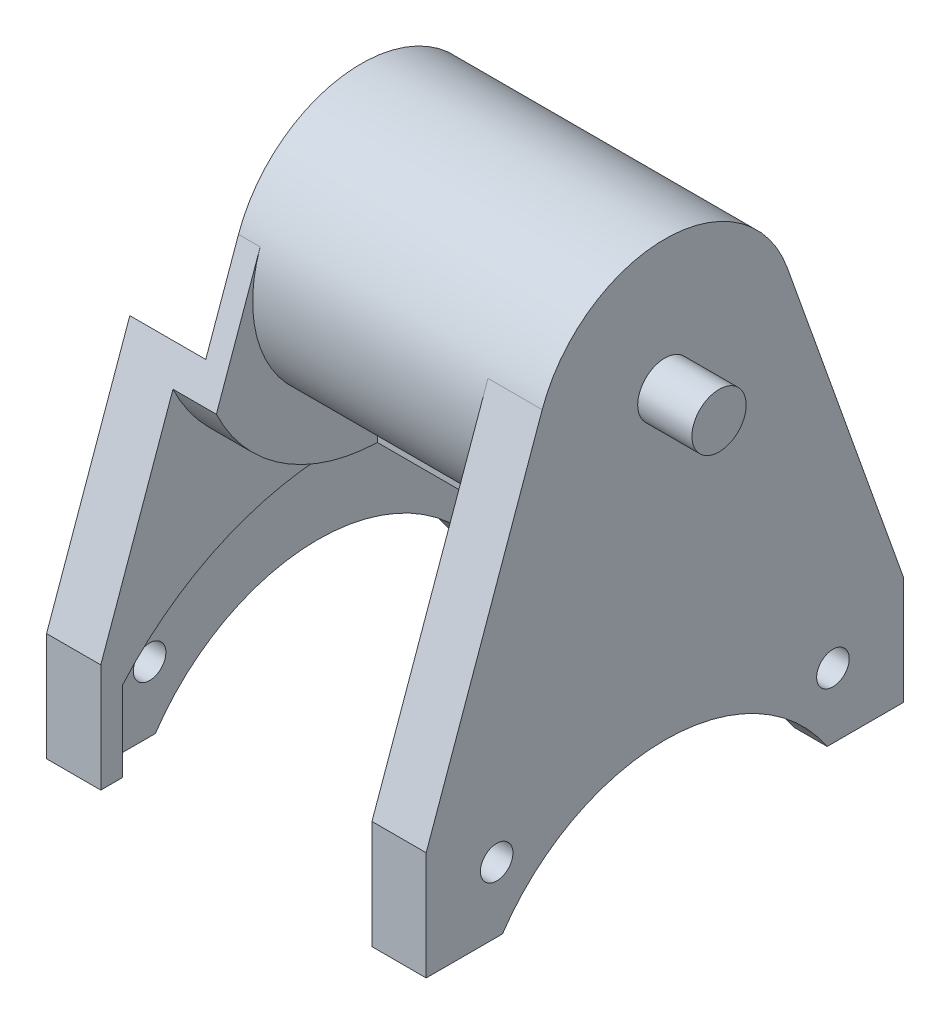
ISO-10303-21;
HEADER;
FILE_DESCRIPTION(('STEP AP214'),'2;1');
FILE_NAME('part.step','',(''),(''),'','','');
FILE_SCHEMA(('AUTOMOTIVE_DESIGN { 1 0 10303 214 1 1 1 1 }'));
ENDSEC;
DATA;
#1=APPLICATION_CONTEXT('core data for automotive mechanical design processes');
#2=APPLICATION_PROTOCOL_DEFINITION('international standard','automotive_design',2000,#1);
#3=PRODUCT_CONTEXT('',#1,'mechanical');
#4=PRODUCT('Part','Part','',(#3));
#5=PRODUCT_RELATED_PRODUCT_CATEGORY('part','',(#4));
#6=PRODUCT_DEFINITION_FORMATION('','',#4);
#7=PRODUCT_DEFINITION_CONTEXT('part definition',#1,'design');
#8=PRODUCT_DEFINITION('design','',#6,#7);
#9=PRODUCT_DEFINITION_SHAPE('','',#8);
#10=(LENGTH_UNIT() NAMED_UNIT(*) SI_UNIT(.MILLI.,.METRE.));
#11=(NAMED_UNIT(*) PLANE_ANGLE_UNIT() SI_UNIT($,.RADIAN.));
#12=(NAMED_UNIT(*) SI_UNIT($,.STERADIAN.) SOLID_ANGLE_UNIT());
#13=UNCERTAINTY_MEASURE_WITH_UNIT(LENGTH_MEASURE(1.E-05),#10,'distance_accuracy_value','');
#14=(GEOMETRIC_REPRESENTATION_CONTEXT(3) GLOBAL_UNCERTAINTY_ASSIGNED_CONTEXT((#13)) GLOBAL_UNIT_ASSIGNED_CONTEXT((#10,
#11,#12)) REPRESENTATION_CONTEXT('',''));
#15=CARTESIAN_POINT('',(0.,0.,0.));
#16=DIRECTION('',(0.,0.,1.));
#17=DIRECTION('',(1.,0.,0.));
#18=AXIS2_PLACEMENT_3D('',#15,#16,#17);
#19=CARTESIAN_POINT('',(-14.5,-46.,0.));
#20=DIRECTION('',(1.,0.,0.));
#21=DIRECTION('',(0.,0.,-1.));
#22=AXIS2_PLACEMENT_3D('',#19,#20,#21);
#23=PLANE('',#22);
#24=DIRECTION('',(0.,1.,0.));
#25=VECTOR('',#24,1.);
#26=CARTESIAN_POINT('',(-14.5,-28.6146613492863,20.));
#27=LINE('',#26,#25);
#28=CARTESIAN_POINT('',(-14.5,-28.6146613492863,20.));
#29=VERTEX_POINT('',#28);
#30=CARTESIAN_POINT('',(-14.5,-36.,20.));
#31=VERTEX_POINT('',#30);
#32=EDGE_CURVE('E229',#29,#31,#27,.F.);
#33=ORIENTED_EDGE('',*,*,#32,.T.);
#34=DIRECTION('',(0.,0.,1.));
#35=VECTOR('',#34,1.);
#36=CARTESIAN_POINT('',(-14.5,-36.,22.));
#37=LINE('',#36,#35);
#38=CARTESIAN_POINT('',(-14.5,-36.,14.9666295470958));
#39=VERTEX_POINT('',#38);
#40=EDGE_CURVE('E257',#31,#39,#37,.F.);
#41=ORIENTED_EDGE('',*,*,#40,.T.);
#42=CARTESIAN_POINT('',(-14.5,-46.,0.));
#43=DIRECTION('',(-1.,0.,0.));
#44=DIRECTION('',(0.,0.,1.));
#45=AXIS2_PLACEMENT_3D('',#42,#43,#44);
#46=CIRCLE('',#45,18.);
#47=CARTESIAN_POINT('',(-14.5,-36.0000000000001,-14.9666295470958));
#48=VERTEX_POINT('',#47);
#49=EDGE_CURVE('E389',#39,#48,#46,.T.);
#50=ORIENTED_EDGE('',*,*,#49,.T.);
#51=DIRECTION('',(0.,0.,1.));
#52=VECTOR('',#51,1.);
#53=CARTESIAN_POINT('',(-14.5,-36.,-22.));
#54=LINE('',#53,#52);
#55=CARTESIAN_POINT('',(-14.5,-36.,-20.));
#56=VERTEX_POINT('',#55);
#57=EDGE_CURVE('E270',#48,#56,#54,.F.);
#58=ORIENTED_EDGE('',*,*,#57,.T.);
#59=DIRECTION('',(0.,1.,0.));
#60=VECTOR('',#59,1.);
#61=CARTESIAN_POINT('',(-14.5,-36.,-20.));
#62=LINE('',#61,#60);
#63=CARTESIAN_POINT('',(-14.5,-28.6146613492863,-20.));
#64=VERTEX_POINT('',#63);
#65=EDGE_CURVE('E224',#56,#64,#62,.T.);
#66=ORIENTED_EDGE('',*,*,#65,.T.);
#67=CARTESIAN_POINT('',(-14.5,-46.,0.));
#68=DIRECTION('',(1.,0.,0.));
#69=DIRECTION('',(0.,0.,-1.));
#70=AXIS2_PLACEMENT_3D('',#67,#68,#69);
#71=CIRCLE('',#70,26.5);
#72=EDGE_CURVE('E20',#64,#29,#71,.T.);
#73=ORIENTED_EDGE('',*,*,#72,.T.);
#74=EDGE_LOOP('',(#33,#41,#50,#58,#66,#73));
#75=FACE_BOUND('',#74,.T.);
#76=CARTESIAN_POINT('',(-14.5,-30.,15.5));
#77=DIRECTION('',(1.,0.,0.));
#78=DIRECTION('',(0.,0.,-1.));
#79=AXIS2_PLACEMENT_3D('',#76,#77,#78);
#80=CIRCLE('',#79,1.5);
#81=CARTESIAN_POINT('',(-14.5,-30.,14.));
#82=VERTEX_POINT('',#81);
#83=EDGE_CURVE('E247',#82,#82,#80,.F.);
#84=ORIENTED_EDGE('',*,*,#83,.T.);
#85=EDGE_LOOP('',(#84));
#86=FACE_BOUND('',#85,.T.);
#87=CARTESIAN_POINT('',(-14.5,-30.,-15.5));
#88=DIRECTION('',(1.,0.,0.));
#89=DIRECTION('',(0.,0.,-1.));
#90=AXIS2_PLACEMENT_3D('',#87,#88,#89);
#91=CIRCLE('',#90,1.50000000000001);
#92=CARTESIAN_POINT('',(-14.5,-30.,-17.));
#93=VERTEX_POINT('',#92);
#94=EDGE_CURVE('E250',#93,#93,#91,.F.);
#95=ORIENTED_EDGE('',*,*,#94,.T.);
#96=EDGE_LOOP('',(#95));
#97=FACE_BOUND('',#96,.T.);
#98=ADVANCED_FACE('F17',(#75,#86,#97),#23,.T.);
#99=CARTESIAN_POINT('',(-0.500000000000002,0.,0.));
#100=DIRECTION('',(-1.,0.,0.));
#101=DIRECTION('',(0.,0.,1.));
#102=AXIS2_PLACEMENT_3D('',#99,#100,#101);
#103=PLANE('',#102);
#104=CARTESIAN_POINT('',(-0.500000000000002,0.,0.));
#105=DIRECTION('',(-1.,0.,0.));
#106=DIRECTION('',(0.,0.,1.));
#107=AXIS2_PLACEMENT_3D('',#104,#105,#106);
#108=CIRCLE('',#107,4.00000000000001);
#109=CARTESIAN_POINT('',(-0.500000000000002,0.,4.00000000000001));
#110=VERTEX_POINT('',#109);
#111=EDGE_CURVE('E385',#110,#110,#108,.T.);
#112=ORIENTED_EDGE('',*,*,#111,.T.);
#113=EDGE_LOOP('',(#112));
#114=FACE_BOUND('',#113,.T.);
#115=ADVANCED_FACE('F886',(#114),#103,.T.);
#116=CARTESIAN_POINT('',(-14.5,-36.,-20.));
#117=DIRECTION('',(0.,0.,-1.));
#118=DIRECTION('',(0.,1.,0.));
#119=AXIS2_PLACEMENT_3D('',#116,#117,#118);
#120=PLANE('',#119);
#121=DIRECTION('',(1.,0.,0.));
#122=VECTOR('',#121,1.);
#123=CARTESIAN_POINT('',(-14.5,-28.6146613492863,-20.));
#124=LINE('',#123,#122);
#125=CARTESIAN_POINT('',(-12.5,-28.6146613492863,-20.));
#126=VERTEX_POINT('',#125);
#127=EDGE_CURVE('E235',#126,#64,#124,.F.);
#128=ORIENTED_EDGE('',*,*,#127,.T.);
#129=ORIENTED_EDGE('',*,*,#65,.F.);
#130=DIRECTION('',(1.,0.,0.));
#131=VECTOR('',#130,1.);
#132=CARTESIAN_POINT('',(17.5,-36.,-20.));
#133=LINE('',#132,#131);
#134=CARTESIAN_POINT('',(-12.5,-36.,-20.));
#135=VERTEX_POINT('',#134);
#136=EDGE_CURVE('E267',#56,#135,#133,.T.);
#137=ORIENTED_EDGE('',*,*,#136,.T.);
#138=DIRECTION('',(0.,1.,0.));
#139=VECTOR('',#138,1.);
#140=CARTESIAN_POINT('',(-12.5,0.,-20.));
#141=LINE('',#140,#139);
#142=EDGE_CURVE('E264',#126,#135,#141,.F.);
#143=ORIENTED_EDGE('',*,*,#142,.F.);
#144=EDGE_LOOP('',(#128,#129,#137,#143));
#145=FACE_BOUND('',#144,.T.);
#146=ADVANCED_FACE('F646',(#145),#120,.F.);
#147=CARTESIAN_POINT('',(-14.5,-28.6146613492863,20.));
#148=DIRECTION('',(0.,0.,1.));
#149=DIRECTION('',(1.,0.,0.));
#150=AXIS2_PLACEMENT_3D('',#147,#148,#149);
#151=PLANE('',#150);
#152=DIRECTION('',(1.,0.,0.));
#153=VECTOR('',#152,1.);
#154=CARTESIAN_POINT('',(17.5,-36.,20.));
#155=LINE('',#154,#153);
#156=CARTESIAN_POINT('',(-12.5,-36.,20.));
#157=VERTEX_POINT('',#156);
#158=EDGE_CURVE('E240',#157,#31,#155,.F.);
#159=ORIENTED_EDGE('',*,*,#158,.T.);
#160=ORIENTED_EDGE('',*,*,#32,.F.);
#161=DIRECTION('',(1.,0.,0.));
#162=VECTOR('',#161,1.);
#163=CARTESIAN_POINT('',(-14.5,-28.6146613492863,20.));
#164=LINE('',#163,#162);
#165=CARTESIAN_POINT('',(-12.5,-28.6146613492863,20.));
#166=VERTEX_POINT('',#165);
#167=EDGE_CURVE('E234',#29,#166,#164,.T.);
#168=ORIENTED_EDGE('',*,*,#167,.T.);
#169=DIRECTION('',(0.,1.,0.));
#170=VECTOR('',#169,1.);
#171=CARTESIAN_POINT('',(-12.5,0.,20.));
#172=LINE('',#171,#170);
#173=EDGE_CURVE('E384',#157,#166,#172,.T.);
#174=ORIENTED_EDGE('',*,*,#173,.F.);
#175=EDGE_LOOP('',(#159,#160,#168,#174));
#176=FACE_BOUND('',#175,.T.);
#177=ADVANCED_FACE('F237',(#176),#151,.F.);
#178=CARTESIAN_POINT('',(-14.5,-46.,0.));
#179=DIRECTION('',(1.,0.,0.));
#180=DIRECTION('',(0.,0.,-1.));
#181=AXIS2_PLACEMENT_3D('',#178,#179,#180);
#182=CYLINDRICAL_SURFACE('',#181,26.5);
#183=ORIENTED_EDGE('',*,*,#167,.F.);
#184=ORIENTED_EDGE('',*,*,#72,.F.);
#185=ORIENTED_EDGE('',*,*,#127,.F.);
#186=CARTESIAN_POINT('',(-12.5,-46.,0.));
#187=DIRECTION('',(1.,0.,0.));
#188=DIRECTION('',(0.,0.,-1.));
#189=AXIS2_PLACEMENT_3D('',#186,#187,#188);
#190=CIRCLE('',#189,26.5);
#191=EDGE_CURVE('E245',#166,#126,#190,.F.);
#192=ORIENTED_EDGE('',*,*,#191,.F.);
#193=EDGE_LOOP('',(#183,#184,#185,#192));
#194=FACE_BOUND('',#193,.T.);
#195=ADVANCED_FACE('F243',(#194),#182,.F.);
#196=CARTESIAN_POINT('',(-17.5,-30.,15.5));
#197=DIRECTION('',(1.,0.,0.));
#198=DIRECTION('',(0.,0.,-1.));
#199=AXIS2_PLACEMENT_3D('',#196,#197,#198);
#200=CYLINDRICAL_SURFACE('',#199,1.5);
#201=CARTESIAN_POINT('',(-17.5,-30.,15.5));
#202=DIRECTION('',(1.,0.,0.));
#203=DIRECTION('',(0.,0.,-1.));
#204=AXIS2_PLACEMENT_3D('',#201,#202,#203);
#205=CIRCLE('',#204,1.5);
#206=CARTESIAN_POINT('',(-17.5,-30.,14.));
#207=VERTEX_POINT('',#206);
#208=EDGE_CURVE('E378',#207,#207,#205,.F.);
#209=ORIENTED_EDGE('',*,*,#208,.T.);
#210=EDGE_LOOP('',(#209));
#211=FACE_BOUND('',#210,.T.);
#212=ORIENTED_EDGE('',*,*,#83,.F.);
#213=EDGE_LOOP('',(#212));
#214=FACE_BOUND('',#213,.T.);
#215=ADVANCED_FACE('F398',(#211,#214),#200,.F.);
#216=CARTESIAN_POINT('',(-17.5,-30.,-15.5));
#217=DIRECTION('',(1.,0.,0.));
#218=DIRECTION('',(0.,0.,-1.));
#219=AXIS2_PLACEMENT_3D('',#216,#217,#218);
#220=CYLINDRICAL_SURFACE('',#219,1.50000000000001);
#221=CARTESIAN_POINT('',(-17.5,-30.,-15.5));
#222=DIRECTION('',(1.,0.,0.));
#223=DIRECTION('',(0.,0.,-1.));
#224=AXIS2_PLACEMENT_3D('',#221,#222,#223);
#225=CIRCLE('',#224,1.50000000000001);
#226=CARTESIAN_POINT('',(-17.5,-30.,-17.));
#227=VERTEX_POINT('',#226);
#228=EDGE_CURVE('E374',#227,#227,#225,.F.);
#229=ORIENTED_EDGE('',*,*,#228,.T.);
#230=EDGE_LOOP('',(#229));
#231=FACE_BOUND('',#230,.T.);
#232=ORIENTED_EDGE('',*,*,#94,.F.);
#233=EDGE_LOOP('',(#232));
#234=FACE_BOUND('',#233,.T.);
#235=ADVANCED_FACE('F395',(#231,#234),#220,.F.);
#236=CARTESIAN_POINT('',(17.5,-36.,22.));
#237=DIRECTION('',(0.,1.,0.));
#238=DIRECTION('',(0.,0.,1.));
#239=AXIS2_PLACEMENT_3D('',#236,#237,#238);
#240=PLANE('',#239);
#241=ORIENTED_EDGE('',*,*,#158,.F.);
#242=DIRECTION('',(0.,0.,-1.));
#243=VECTOR('',#242,1.);
#244=CARTESIAN_POINT('',(-12.5,-36.,0.));
#245=LINE('',#244,#243);
#246=CARTESIAN_POINT('',(-12.5,-36.,22.));
#247=VERTEX_POINT('',#246);
#248=EDGE_CURVE('E603',#247,#157,#245,.T.);
#249=ORIENTED_EDGE('',*,*,#248,.F.);
#250=DIRECTION('',(-1.,0.,0.));
#251=VECTOR('',#250,1.);
#252=CARTESIAN_POINT('',(17.5,-36.,22.));
#253=LINE('',#252,#251);
#254=CARTESIAN_POINT('',(-17.5,-36.,22.));
#255=VERTEX_POINT('',#254);
#256=EDGE_CURVE('E383',#247,#255,#253,.T.);
#257=ORIENTED_EDGE('',*,*,#256,.T.);
#258=DIRECTION('',(0.,0.,-1.));
#259=VECTOR('',#258,1.);
#260=CARTESIAN_POINT('',(-17.5,-36.,0.));
#261=LINE('',#260,#259);
#262=CARTESIAN_POINT('',(-17.5,-36.,14.9666295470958));
#263=VERTEX_POINT('',#262);
#264=EDGE_CURVE('E373',#255,#263,#261,.T.);
#265=ORIENTED_EDGE('',*,*,#264,.T.);
#266=DIRECTION('',(-1.,0.,0.));
#267=VECTOR('',#266,1.);
#268=CARTESIAN_POINT('',(17.5,-36.,14.9666295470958));
#269=LINE('',#268,#267);
#270=EDGE_CURVE('E281',#263,#39,#269,.F.);
#271=ORIENTED_EDGE('',*,*,#270,.T.);
#272=ORIENTED_EDGE('',*,*,#40,.F.);
#273=EDGE_LOOP('',(#241,#249,#257,#265,#271,#272));
#274=FACE_BOUND('',#273,.T.);
#275=ADVANCED_FACE('F397',(#274),#240,.F.);
#276=CARTESIAN_POINT('',(17.5,-46.,0.));
#277=DIRECTION('',(-1.,0.,0.));
#278=DIRECTION('',(0.,0.,1.));
#279=AXIS2_PLACEMENT_3D('',#276,#277,#278);
#280=CYLINDRICAL_SURFACE('',#279,18.);
#281=ORIENTED_EDGE('',*,*,#270,.F.);
#282=CARTESIAN_POINT('',(-17.5,-46.,0.));
#283=DIRECTION('',(-1.,0.,0.));
#284=DIRECTION('',(0.,0.,1.));
#285=AXIS2_PLACEMENT_3D('',#282,#283,#284);
#286=CIRCLE('',#285,18.);
#287=CARTESIAN_POINT('',(-17.5,-36.,-14.9666295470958));
#288=VERTEX_POINT('',#287);
#289=EDGE_CURVE('E370',#263,#288,#286,.T.);
#290=ORIENTED_EDGE('',*,*,#289,.T.);
#291=DIRECTION('',(1.,0.,0.));
#292=VECTOR('',#291,1.);
#293=CARTESIAN_POINT('',(17.5,-36.0000000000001,-14.9666295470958));
#294=LINE('',#293,#292);
#295=EDGE_CURVE('E277',#288,#48,#294,.T.);
#296=ORIENTED_EDGE('',*,*,#295,.T.);
#297=ORIENTED_EDGE('',*,*,#49,.F.);
#298=EDGE_LOOP('',(#281,#290,#296,#297));
#299=FACE_BOUND('',#298,.T.);
#300=ADVANCED_FACE('F406',(#299),#280,.F.);
#301=CARTESIAN_POINT('',(17.5,-36.,-22.));
#302=DIRECTION('',(0.,1.,0.));
#303=DIRECTION('',(0.,0.,1.));
#304=AXIS2_PLACEMENT_3D('',#301,#302,#303);
#305=PLANE('',#304);
#306=ORIENTED_EDGE('',*,*,#136,.F.);
#307=ORIENTED_EDGE('',*,*,#57,.F.);
#308=ORIENTED_EDGE('',*,*,#295,.F.);
#309=DIRECTION('',(0.,0.,-1.));
#310=VECTOR('',#309,1.);
#311=CARTESIAN_POINT('',(-17.5,-36.,0.));
#312=LINE('',#311,#310);
#313=CARTESIAN_POINT('',(-17.5,-36.,-22.));
#314=VERTEX_POINT('',#313);
#315=EDGE_CURVE('E372',#288,#314,#312,.T.);
#316=ORIENTED_EDGE('',*,*,#315,.T.);
#317=DIRECTION('',(1.,0.,0.));
#318=VECTOR('',#317,1.);
#319=CARTESIAN_POINT('',(17.5,-36.,-22.));
#320=LINE('',#319,#318);
#321=CARTESIAN_POINT('',(-12.5,-36.,-22.));
#322=VERTEX_POINT('',#321);
#323=EDGE_CURVE('E388',#314,#322,#320,.T.);
#324=ORIENTED_EDGE('',*,*,#323,.T.);
#325=DIRECTION('',(0.,0.,-1.));
#326=VECTOR('',#325,1.);
#327=CARTESIAN_POINT('',(-12.5,-36.,0.));
#328=LINE('',#327,#326);
#329=EDGE_CURVE('E260',#135,#322,#328,.T.);
#330=ORIENTED_EDGE('',*,*,#329,.F.);
#331=EDGE_LOOP('',(#306,#307,#308,#316,#324,#330));
#332=FACE_BOUND('',#331,.T.);
#333=ADVANCED_FACE('F553',(#332),#305,.F.);
#334=CARTESIAN_POINT('',(-8.5,-16.9926454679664,-0.500000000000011));
#335=DIRECTION('',(0.,1.,0.));
#336=DIRECTION('',(-1.,0.,0.));
#337=AXIS2_PLACEMENT_3D('',#334,#335,#336);
#338=PLANE('',#337);
#339=DIRECTION('',(-1.,0.,0.));
#340=VECTOR('',#339,1.);
#341=CARTESIAN_POINT('',(-8.5,-16.9926454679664,0.5));
#342=LINE('',#341,#340);
#343=CARTESIAN_POINT('',(12.5,-16.9926454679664,0.499999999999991));
#344=VERTEX_POINT('',#343);
#345=CARTESIAN_POINT('',(-8.5,-16.9926454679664,0.499999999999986));
#346=VERTEX_POINT('',#345);
#347=EDGE_CURVE('E676',#344,#346,#342,.T.);
#348=ORIENTED_EDGE('',*,*,#347,.T.);
#349=CARTESIAN_POINT('',(-8.5,0.,0.));
#350=DIRECTION('',(-1.,0.,0.));
#351=DIRECTION('',(0.,-0.999567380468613,-0.0294117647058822));
#352=AXIS2_PLACEMENT_3D('',#349,#350,#351);
#353=CIRCLE('',#352,17.);
#354=CARTESIAN_POINT('',(-8.5,-16.9926454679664,-0.499999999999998));
#355=VERTEX_POINT('',#354);
#356=EDGE_CURVE('E366',#355,#346,#353,.T.);
#357=ORIENTED_EDGE('',*,*,#356,.F.);
#358=DIRECTION('',(1.,0.,0.));
#359=VECTOR('',#358,1.);
#360=CARTESIAN_POINT('',(-8.5,-16.9926454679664,-0.5));
#361=LINE('',#360,#359);
#362=CARTESIAN_POINT('',(12.5,-16.9926454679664,-0.500000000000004));
#363=VERTEX_POINT('',#362);
#364=EDGE_CURVE('E365',#355,#363,#361,.T.);
#365=ORIENTED_EDGE('',*,*,#364,.T.);
#366=DIRECTION('',(0.,0.,1.));
#367=VECTOR('',#366,1.);
#368=CARTESIAN_POINT('',(12.5,-16.9926454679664,-0.500000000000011));
#369=LINE('',#368,#367);
#370=EDGE_CURVE('E269',#344,#363,#369,.F.);
#371=ORIENTED_EDGE('',*,*,#370,.F.);
#372=EDGE_LOOP('',(#348,#357,#365,#371));
#373=FACE_BOUND('',#372,.T.);
#374=ADVANCED_FACE('F542',(#373),#338,.F.);
#375=CARTESIAN_POINT('',(17.5,-26.,-22.));
#376=DIRECTION('',(0.,0.,1.));
#377=DIRECTION('',(1.,0.,0.));
#378=AXIS2_PLACEMENT_3D('',#375,#376,#377);
#379=PLANE('',#378);
#380=ORIENTED_EDGE('',*,*,#323,.F.);
#381=DIRECTION('',(0.,1.,0.));
#382=VECTOR('',#381,1.);
#383=CARTESIAN_POINT('',(-17.5,0.,-22.));
#384=LINE('',#383,#382);
#385=CARTESIAN_POINT('',(-17.5,-26.,-22.));
#386=VERTEX_POINT('',#385);
#387=EDGE_CURVE('E369',#314,#386,#384,.T.);
#388=ORIENTED_EDGE('',*,*,#387,.T.);
#389=DIRECTION('',(1.,0.,0.));
#390=VECTOR('',#389,1.);
#391=CARTESIAN_POINT('',(17.5,-26.,-22.));
#392=LINE('',#391,#390);
#393=CARTESIAN_POINT('',(-12.5,-26.,-22.));
#394=VERTEX_POINT('',#393);
#395=EDGE_CURVE('E619',#386,#394,#392,.T.);
#396=ORIENTED_EDGE('',*,*,#395,.T.);
#397=DIRECTION('',(0.,1.,0.));
#398=VECTOR('',#397,1.);
#399=CARTESIAN_POINT('',(-12.5,0.,-22.));
#400=LINE('',#399,#398);
#401=EDGE_CURVE('E263',#322,#394,#400,.T.);
#402=ORIENTED_EDGE('',*,*,#401,.F.);
#403=EDGE_LOOP('',(#380,#388,#396,#402));
#404=FACE_BOUND('',#403,.T.);
#405=ADVANCED_FACE('F552',(#404),#379,.F.);
#406=CARTESIAN_POINT('',(-0.500000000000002,0.,0.));
#407=DIRECTION('',(-1.,0.,0.));
#408=DIRECTION('',(0.,0.,1.));
#409=AXIS2_PLACEMENT_3D('',#406,#407,#408);
#410=CYLINDRICAL_SURFACE('',#409,4.00000000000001);
#411=CARTESIAN_POINT('',(-10.5,0.,0.));
#412=DIRECTION('',(-1.,0.,0.));
#413=DIRECTION('',(0.,0.,1.));
#414=AXIS2_PLACEMENT_3D('',#411,#412,#413);
#415=CIRCLE('',#414,4.00000000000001);
#416=CARTESIAN_POINT('',(-10.5,0.,4.00000000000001));
#417=VERTEX_POINT('',#416);
#418=EDGE_CURVE('E352',#417,#417,#415,.F.);
#419=ORIENTED_EDGE('',*,*,#418,.F.);
#420=EDGE_LOOP('',(#419));
#421=FACE_BOUND('',#420,.T.);
#422=ORIENTED_EDGE('',*,*,#111,.F.);
#423=EDGE_LOOP('',(#422));
#424=FACE_BOUND('',#423,.T.);
#425=ADVANCED_FACE('F876',(#421,#424),#410,.F.);
#426=CARTESIAN_POINT('',(-12.5,0.,0.));
#427=DIRECTION('',(1.,0.,0.));
#428=DIRECTION('',(0.,0.,-1.));
#429=AXIS2_PLACEMENT_3D('',#426,#427,#428);
#430=PLANE('',#429);
#431=ORIENTED_EDGE('',*,*,#173,.T.);
#432=ORIENTED_EDGE('',*,*,#191,.T.);
#433=ORIENTED_EDGE('',*,*,#142,.T.);
#434=ORIENTED_EDGE('',*,*,#329,.T.);
#435=ORIENTED_EDGE('',*,*,#401,.T.);
#436=DIRECTION('',(0.,-0.942020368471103,-0.335555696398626));
#437=VECTOR('',#436,1.);
#438=CARTESIAN_POINT('',(-12.5,4.02666835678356,-11.3042444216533));
#439=LINE('',#438,#437);
#440=CARTESIAN_POINT('',(-12.5,-7.31675900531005,-15.3448700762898));
#441=VERTEX_POINT('',#440);
#442=EDGE_CURVE('E355',#394,#441,#439,.F.);
#443=ORIENTED_EDGE('',*,*,#442,.T.);
#444=CARTESIAN_POINT('',(-12.5,0.,0.));
#445=DIRECTION('',(-1.,0.,0.));
#446=DIRECTION('',(0.,0.,1.));
#447=AXIS2_PLACEMENT_3D('',#444,#445,#446);
#448=CIRCLE('',#447,17.);
#449=CARTESIAN_POINT('',(-12.5,-7.31675900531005,15.3448700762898));
#450=VERTEX_POINT('',#449);
#451=EDGE_CURVE('E363',#450,#441,#448,.F.);
#452=ORIENTED_EDGE('',*,*,#451,.F.);
#453=DIRECTION('',(0.,0.942020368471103,-0.335555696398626));
#454=VECTOR('',#453,1.);
#455=CARTESIAN_POINT('',(-12.5,4.02666835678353,11.3042444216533));
#456=LINE('',#455,#454);
#457=CARTESIAN_POINT('',(-12.5,-26.,22.));
#458=VERTEX_POINT('',#457);
#459=EDGE_CURVE('E350',#450,#458,#456,.F.);
#460=ORIENTED_EDGE('',*,*,#459,.T.);
#461=DIRECTION('',(0.,1.,0.));
#462=VECTOR('',#461,1.);
#463=CARTESIAN_POINT('',(-12.5,-26.,22.));
#464=LINE('',#463,#462);
#465=EDGE_CURVE('E381',#458,#247,#464,.F.);
#466=ORIENTED_EDGE('',*,*,#465,.T.);
#467=ORIENTED_EDGE('',*,*,#248,.T.);
#468=EDGE_LOOP('',(#431,#432,#433,#434,#435,#443,#452,#460,#466,#467));
#469=FACE_BOUND('',#468,.T.);
#470=ADVANCED_FACE('F644',(#469),#430,.T.);
#471=CARTESIAN_POINT('',(17.5,-26.,22.));
#472=DIRECTION('',(0.,0.,-1.));
#473=DIRECTION('',(-1.,0.,0.));
#474=AXIS2_PLACEMENT_3D('',#471,#472,#473);
#475=PLANE('',#474);
#476=DIRECTION('',(1.,0.,0.));
#477=VECTOR('',#476,1.);
#478=CARTESIAN_POINT('',(17.5,-26.,22.));
#479=LINE('',#478,#477);
#480=CARTESIAN_POINT('',(-17.5,-26.,22.));
#481=VERTEX_POINT('',#480);
#482=EDGE_CURVE('E593',#458,#481,#479,.F.);
#483=ORIENTED_EDGE('',*,*,#482,.T.);
#484=DIRECTION('',(0.,1.,0.));
#485=VECTOR('',#484,1.);
#486=CARTESIAN_POINT('',(-17.5,0.,22.));
#487=LINE('',#486,#485);
#488=EDGE_CURVE('E377',#481,#255,#487,.F.);
#489=ORIENTED_EDGE('',*,*,#488,.T.);
#490=ORIENTED_EDGE('',*,*,#256,.F.);
#491=ORIENTED_EDGE('',*,*,#465,.F.);
#492=EDGE_LOOP('',(#483,#489,#490,#491));
#493=FACE_BOUND('',#492,.T.);
#494=ADVANCED_FACE('F657',(#493),#475,.F.);
#495=CARTESIAN_POINT('',(-17.5,0.,0.));
#496=DIRECTION('',(1.,0.,0.));
#497=DIRECTION('',(0.,0.,-1.));
#498=AXIS2_PLACEMENT_3D('',#495,#496,#497);
#499=PLANE('',#498);
#500=CARTESIAN_POINT('',(-17.5,0.,0.));
#501=DIRECTION('',(-1.,0.,0.));
#502=DIRECTION('',(0.,0.,1.));
#503=AXIS2_PLACEMENT_3D('',#500,#501,#502);
#504=CIRCLE('',#503,15.);
#505=CARTESIAN_POINT('',(-17.5,-4.45151495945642,14.3242456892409));
#506=VERTEX_POINT('',#505);
#507=CARTESIAN_POINT('',(-17.5,-4.45151495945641,-14.3242456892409));
#508=VERTEX_POINT('',#507);
#509=EDGE_CURVE('E367',#506,#508,#504,.F.);
#510=ORIENTED_EDGE('',*,*,#509,.T.);
#511=DIRECTION('',(0.,-0.942020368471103,-0.335555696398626));
#512=VECTOR('',#511,1.);
#513=CARTESIAN_POINT('',(-17.5,4.02666835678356,-11.3042444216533));
#514=LINE('',#513,#512);
#515=EDGE_CURVE('E613',#508,#386,#514,.T.);
#516=ORIENTED_EDGE('',*,*,#515,.T.);
#517=ORIENTED_EDGE('',*,*,#387,.F.);
#518=ORIENTED_EDGE('',*,*,#315,.F.);
#519=ORIENTED_EDGE('',*,*,#289,.F.);
#520=ORIENTED_EDGE('',*,*,#264,.F.);
#521=ORIENTED_EDGE('',*,*,#488,.F.);
#522=DIRECTION('',(0.,0.942020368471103,-0.335555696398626));
#523=VECTOR('',#522,1.);
#524=CARTESIAN_POINT('',(-17.5,4.02666835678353,11.3042444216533));
#525=LINE('',#524,#523);
#526=EDGE_CURVE('E595',#481,#506,#525,.T.);
#527=ORIENTED_EDGE('',*,*,#526,.T.);
#528=EDGE_LOOP('',(#510,#516,#517,#518,#519,#520,#521,#527));
#529=FACE_BOUND('',#528,.T.);
#530=ORIENTED_EDGE('',*,*,#228,.F.);
#531=EDGE_LOOP('',(#530));
#532=FACE_BOUND('',#531,.T.);
#533=ORIENTED_EDGE('',*,*,#208,.F.);
#534=EDGE_LOOP('',(#533));
#535=FACE_BOUND('',#534,.T.);
#536=ADVANCED_FACE('F572',(#529,#532,#535),#499,.F.);
#537=CARTESIAN_POINT('',(-10.5,0.,0.));
#538=DIRECTION('',(-1.,0.,0.));
#539=DIRECTION('',(0.,0.,1.));
#540=AXIS2_PLACEMENT_3D('',#537,#538,#539);
#541=CYLINDRICAL_SURFACE('',#540,15.);
#542=DIRECTION('',(1.,0.,0.));
#543=VECTOR('',#542,1.);
#544=CARTESIAN_POINT('',(17.5,-4.45151495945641,-14.3242456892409));
#545=LINE('',#544,#543);
#546=CARTESIAN_POINT('',(-10.5,-4.45151495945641,-14.3242456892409));
#547=VERTEX_POINT('',#546);
#548=EDGE_CURVE('E610',#547,#508,#545,.F.);
#549=ORIENTED_EDGE('',*,*,#548,.T.);
#550=ORIENTED_EDGE('',*,*,#509,.F.);
#551=DIRECTION('',(1.,0.,0.));
#552=VECTOR('',#551,1.);
#553=CARTESIAN_POINT('',(17.5,-4.45151495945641,14.3242456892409));
#554=LINE('',#553,#552);
#555=CARTESIAN_POINT('',(-10.5,-4.45151495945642,14.3242456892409));
#556=VERTEX_POINT('',#555);
#557=EDGE_CURVE('E664',#506,#556,#554,.T.);
#558=ORIENTED_EDGE('',*,*,#557,.T.);
#559=CARTESIAN_POINT('',(-10.5,0.,0.));
#560=DIRECTION('',(-1.,0.,0.));
#561=DIRECTION('',(0.,0.,1.));
#562=AXIS2_PLACEMENT_3D('',#559,#560,#561);
#563=CIRCLE('',#562,15.);
#564=EDGE_CURVE('E347',#547,#556,#563,.T.);
#565=ORIENTED_EDGE('',*,*,#564,.F.);
#566=EDGE_LOOP('',(#549,#550,#558,#565));
#567=FACE_BOUND('',#566,.T.);
#568=ADVANCED_FACE('F519',(#567),#541,.F.);
#569=CARTESIAN_POINT('',(-10.5,0.,0.));
#570=DIRECTION('',(-1.,0.,0.));
#571=DIRECTION('',(0.,0.,1.));
#572=AXIS2_PLACEMENT_3D('',#569,#570,#571);
#573=CYLINDRICAL_SURFACE('',#572,17.);
#574=ORIENTED_EDGE('',*,*,#451,.T.);
#575=DIRECTION('',(1.,0.,0.));
#576=VECTOR('',#575,1.);
#577=CARTESIAN_POINT('',(17.5,-7.31675900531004,-15.3448700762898));
#578=LINE('',#577,#576);
#579=CARTESIAN_POINT('',(-8.5,-7.31675900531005,-15.3448700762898));
#580=VERTEX_POINT('',#579);
#581=EDGE_CURVE('E615',#441,#580,#578,.T.);
#582=ORIENTED_EDGE('',*,*,#581,.T.);
#583=CARTESIAN_POINT('',(-8.5,0.,0.));
#584=DIRECTION('',(-1.,0.,0.));
#585=DIRECTION('',(0.,0.,1.));
#586=AXIS2_PLACEMENT_3D('',#583,#584,#585);
#587=CIRCLE('',#586,17.);
#588=EDGE_CURVE('E356',#580,#355,#587,.T.);
#589=ORIENTED_EDGE('',*,*,#588,.T.);
#590=ORIENTED_EDGE('',*,*,#356,.T.);
#591=CARTESIAN_POINT('',(-8.5,0.,0.));
#592=DIRECTION('',(-1.,0.,0.));
#593=DIRECTION('',(0.,0.,1.));
#594=AXIS2_PLACEMENT_3D('',#591,#592,#593);
#595=CIRCLE('',#594,17.);
#596=CARTESIAN_POINT('',(-8.5,-7.31675900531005,15.3448700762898));
#597=VERTEX_POINT('',#596);
#598=EDGE_CURVE('E341',#346,#597,#595,.T.);
#599=ORIENTED_EDGE('',*,*,#598,.T.);
#600=DIRECTION('',(1.,0.,0.));
#601=VECTOR('',#600,1.);
#602=CARTESIAN_POINT('',(17.5,-7.31675900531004,15.3448700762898));
#603=LINE('',#602,#601);
#604=EDGE_CURVE('E671',#597,#450,#603,.F.);
#605=ORIENTED_EDGE('',*,*,#604,.T.);
#606=EDGE_LOOP('',(#574,#582,#589,#590,#599,#605));
#607=FACE_BOUND('',#606,.T.);
#608=ADVANCED_FACE('F514',(#607),#573,.T.);
#609=CARTESIAN_POINT('',(-8.5,-11.9895788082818,-0.5));
#610=DIRECTION('',(0.,0.,1.));
#611=DIRECTION('',(1.,0.,0.));
#612=AXIS2_PLACEMENT_3D('',#609,#610,#611);
#613=PLANE('',#612);
#614=ORIENTED_EDGE('',*,*,#364,.F.);
#615=DIRECTION('',(0.,1.,0.));
#616=VECTOR('',#615,1.);
#617=CARTESIAN_POINT('',(-8.5,0.,-0.49999999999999));
#618=LINE('',#617,#616);
#619=CARTESIAN_POINT('',(-8.5,-11.9895788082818,-0.499999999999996));
#620=VERTEX_POINT('',#619);
#621=EDGE_CURVE('E359',#355,#620,#618,.T.);
#622=ORIENTED_EDGE('',*,*,#621,.T.);
#623=DIRECTION('',(-1.,0.,0.));
#624=VECTOR('',#623,1.);
#625=CARTESIAN_POINT('',(17.5,-11.9895788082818,-0.500000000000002));
#626=LINE('',#625,#624);
#627=CARTESIAN_POINT('',(12.5,-11.9895788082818,-0.500000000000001));
#628=VERTEX_POINT('',#627);
#629=EDGE_CURVE('E360',#628,#620,#626,.T.);
#630=ORIENTED_EDGE('',*,*,#629,.F.);
#631=DIRECTION('',(0.,1.,0.));
#632=VECTOR('',#631,1.);
#633=CARTESIAN_POINT('',(12.5,0.,-0.5));
#634=LINE('',#633,#632);
#635=EDGE_CURVE('E748',#628,#363,#634,.F.);
#636=ORIENTED_EDGE('',*,*,#635,.T.);
#637=EDGE_LOOP('',(#614,#622,#630,#636));
#638=FACE_BOUND('',#637,.T.);
#639=ADVANCED_FACE('F510',(#638),#613,.F.);
#640=CARTESIAN_POINT('',(-8.5,-11.9895788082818,0.5));
#641=DIRECTION('',(0.,0.,-1.));
#642=DIRECTION('',(-1.,0.,0.));
#643=AXIS2_PLACEMENT_3D('',#640,#641,#642);
#644=PLANE('',#643);
#645=DIRECTION('',(-1.,0.,0.));
#646=VECTOR('',#645,1.);
#647=CARTESIAN_POINT('',(17.5,-11.9895788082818,0.499999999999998));
#648=LINE('',#647,#646);
#649=CARTESIAN_POINT('',(-8.5,-11.9895788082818,0.5));
#650=VERTEX_POINT('',#649);
#651=CARTESIAN_POINT('',(12.5,-11.9895788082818,0.499999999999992));
#652=VERTEX_POINT('',#651);
#653=EDGE_CURVE('E683',#650,#652,#648,.F.);
#654=ORIENTED_EDGE('',*,*,#653,.F.);
#655=DIRECTION('',(0.,1.,0.));
#656=VECTOR('',#655,1.);
#657=CARTESIAN_POINT('',(-8.5,0.,0.5));
#658=LINE('',#657,#656);
#659=EDGE_CURVE('E344',#650,#346,#658,.F.);
#660=ORIENTED_EDGE('',*,*,#659,.T.);
#661=ORIENTED_EDGE('',*,*,#347,.F.);
#662=DIRECTION('',(0.,1.,0.));
#663=VECTOR('',#662,1.);
#664=CARTESIAN_POINT('',(12.5,0.,0.499999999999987));
#665=LINE('',#664,#663);
#666=EDGE_CURVE('E758',#344,#652,#665,.T.);
#667=ORIENTED_EDGE('',*,*,#666,.T.);
#668=EDGE_LOOP('',(#654,#660,#661,#667));
#669=FACE_BOUND('',#668,.T.);
#670=ADVANCED_FACE('F506',(#669),#644,.F.);
#671=CARTESIAN_POINT('',(-14.5,-46.,0.));
#672=DIRECTION('',(1.,0.,0.));
#673=DIRECTION('',(0.,0.,-1.));
#674=AXIS2_PLACEMENT_3D('',#671,#672,#673);
#675=CYLINDRICAL_SURFACE('',#674,26.5);
#676=CARTESIAN_POINT('',(14.5,-46.,0.));
#677=DIRECTION('',(1.,0.,0.));
#678=DIRECTION('',(0.,0.,-1.));
#679=AXIS2_PLACEMENT_3D('',#676,#677,#678);
#680=CIRCLE('',#679,26.5);
#681=CARTESIAN_POINT('',(14.5,-28.6146613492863,-20.));
#682=VERTEX_POINT('',#681);
#683=CARTESIAN_POINT('',(14.5,-28.6146613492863,20.));
#684=VERTEX_POINT('',#683);
#685=EDGE_CURVE('E337',#682,#684,#680,.T.);
#686=ORIENTED_EDGE('',*,*,#685,.T.);
#687=DIRECTION('',(1.,0.,0.));
#688=VECTOR('',#687,1.);
#689=CARTESIAN_POINT('',(-14.5,-28.6146613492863,20.));
#690=LINE('',#689,#688);
#691=CARTESIAN_POINT('',(12.5,-28.6146613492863,20.));
#692=VERTEX_POINT('',#691);
#693=EDGE_CURVE('E686',#684,#692,#690,.F.);
#694=ORIENTED_EDGE('',*,*,#693,.T.);
#695=CARTESIAN_POINT('',(12.5,-46.,0.));
#696=DIRECTION('',(1.,0.,0.));
#697=DIRECTION('',(0.,0.,-1.));
#698=AXIS2_PLACEMENT_3D('',#695,#696,#697);
#699=CIRCLE('',#698,26.5);
#700=CARTESIAN_POINT('',(12.5,-28.6146613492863,-20.));
#701=VERTEX_POINT('',#700);
#702=EDGE_CURVE('E334',#692,#701,#699,.F.);
#703=ORIENTED_EDGE('',*,*,#702,.T.);
#704=DIRECTION('',(1.,0.,0.));
#705=VECTOR('',#704,1.);
#706=CARTESIAN_POINT('',(-14.5,-28.6146613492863,-20.));
#707=LINE('',#706,#705);
#708=EDGE_CURVE('E688',#701,#682,#707,.T.);
#709=ORIENTED_EDGE('',*,*,#708,.T.);
#710=EDGE_LOOP('',(#686,#694,#703,#709));
#711=FACE_BOUND('',#710,.T.);
#712=ADVANCED_FACE('F502',(#711),#675,.F.);
#713=CARTESIAN_POINT('',(22.5,0.,0.));
#714=DIRECTION('',(1.,0.,0.));
#715=DIRECTION('',(0.,0.,-1.));
#716=AXIS2_PLACEMENT_3D('',#713,#714,#715);
#717=PLANE('',#716);
#718=CARTESIAN_POINT('',(22.5,0.,0.));
#719=DIRECTION('',(-1.,0.,0.));
#720=DIRECTION('',(0.,0.,1.));
#721=AXIS2_PLACEMENT_3D('',#718,#719,#720);
#722=CIRCLE('',#721,2.5);
#723=CARTESIAN_POINT('',(22.5,0.,2.5));
#724=VERTEX_POINT('',#723);
#725=EDGE_CURVE('E324',#724,#724,#722,.T.);
#726=ORIENTED_EDGE('',*,*,#725,.F.);
#727=EDGE_LOOP('',(#726));
#728=FACE_BOUND('',#727,.T.);
#729=ADVANCED_FACE('F498',(#728),#717,.T.);
#730=CARTESIAN_POINT('',(-8.5,0.,0.));
#731=DIRECTION('',(-1.,0.,0.));
#732=DIRECTION('',(0.,0.,1.));
#733=AXIS2_PLACEMENT_3D('',#730,#731,#732);
#734=PLANE('',#733);
#735=CARTESIAN_POINT('',(-8.5,0.,0.));
#736=DIRECTION('',(-1.,0.,0.));
#737=DIRECTION('',(0.,0.,1.));
#738=AXIS2_PLACEMENT_3D('',#735,#736,#737);
#739=CIRCLE('',#738,12.);
#740=CARTESIAN_POINT('',(-8.5,4.02666835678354,-11.3042444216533));
#741=VERTEX_POINT('',#740);
#742=EDGE_CURVE('E319',#620,#741,#739,.F.);
#743=ORIENTED_EDGE('',*,*,#742,.F.);
#744=ORIENTED_EDGE('',*,*,#621,.F.);
#745=ORIENTED_EDGE('',*,*,#588,.F.);
#746=DIRECTION('',(0.,-0.942020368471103,-0.335555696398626));
#747=VECTOR('',#746,1.);
#748=CARTESIAN_POINT('',(-8.5,4.02666835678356,-11.3042444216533));
#749=LINE('',#748,#747);
#750=EDGE_CURVE('E614',#580,#741,#749,.F.);
#751=ORIENTED_EDGE('',*,*,#750,.T.);
#752=EDGE_LOOP('',(#743,#744,#745,#751));
#753=FACE_BOUND('',#752,.T.);
#754=ADVANCED_FACE('F494',(#753),#734,.F.);
#755=CARTESIAN_POINT('',(17.5,4.02666835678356,-11.3042444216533));
#756=DIRECTION('',(0.,-0.335555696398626,0.942020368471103));
#757=DIRECTION('',(0.,-0.942020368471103,-0.335555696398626));
#758=AXIS2_PLACEMENT_3D('',#755,#756,#757);
#759=PLANE('',#758);
#760=ORIENTED_EDGE('',*,*,#395,.F.);
#761=ORIENTED_EDGE('',*,*,#515,.F.);
#762=ORIENTED_EDGE('',*,*,#548,.F.);
#763=DIRECTION('',(0.,-0.942020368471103,-0.335555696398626));
#764=VECTOR('',#763,1.);
#765=CARTESIAN_POINT('',(-10.5,4.02666835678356,-11.3042444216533));
#766=LINE('',#765,#764);
#767=CARTESIAN_POINT('',(-10.5,4.02666835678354,-11.3042444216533));
#768=VERTEX_POINT('',#767);
#769=EDGE_CURVE('E351',#768,#547,#766,.T.);
#770=ORIENTED_EDGE('',*,*,#769,.F.);
#771=DIRECTION('',(-1.,0.,0.));
#772=VECTOR('',#771,1.);
#773=CARTESIAN_POINT('',(17.5,4.02666835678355,-11.3042444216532));
#774=LINE('',#773,#772);
#775=EDGE_CURVE('E318',#741,#768,#774,.T.);
#776=ORIENTED_EDGE('',*,*,#775,.F.);
#777=ORIENTED_EDGE('',*,*,#750,.F.);
#778=ORIENTED_EDGE('',*,*,#581,.F.);
#779=ORIENTED_EDGE('',*,*,#442,.F.);
#780=EDGE_LOOP('',(#760,#761,#762,#770,#776,#777,#778,#779));
#781=FACE_BOUND('',#780,.T.);
#782=ADVANCED_FACE('F490',(#781),#759,.F.);
#783=CARTESIAN_POINT('',(-10.5,0.,0.));
#784=DIRECTION('',(-1.,0.,0.));
#785=DIRECTION('',(0.,0.,1.));
#786=AXIS2_PLACEMENT_3D('',#783,#784,#785);
#787=PLANE('',#786);
#788=ORIENTED_EDGE('',*,*,#769,.T.);
#789=ORIENTED_EDGE('',*,*,#564,.T.);
#790=DIRECTION('',(0.,0.942020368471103,-0.335555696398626));
#791=VECTOR('',#790,1.);
#792=CARTESIAN_POINT('',(-10.5,4.02666835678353,11.3042444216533));
#793=LINE('',#792,#791);
#794=CARTESIAN_POINT('',(-10.5,4.02666835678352,11.3042444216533));
#795=VERTEX_POINT('',#794);
#796=EDGE_CURVE('E665',#556,#795,#793,.T.);
#797=ORIENTED_EDGE('',*,*,#796,.T.);
#798=CARTESIAN_POINT('',(-10.5,0.,0.));
#799=DIRECTION('',(-1.,0.,0.));
#800=DIRECTION('',(0.,0.,1.));
#801=AXIS2_PLACEMENT_3D('',#798,#799,#800);
#802=CIRCLE('',#801,12.);
#803=EDGE_CURVE('E315',#768,#795,#802,.F.);
#804=ORIENTED_EDGE('',*,*,#803,.F.);
#805=EDGE_LOOP('',(#788,#789,#797,#804));
#806=FACE_BOUND('',#805,.T.);
#807=ORIENTED_EDGE('',*,*,#418,.T.);
#808=EDGE_LOOP('',(#807));
#809=FACE_BOUND('',#808,.T.);
#810=ADVANCED_FACE('F486',(#806,#809),#787,.T.);
#811=CARTESIAN_POINT('',(17.5,4.02666835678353,11.3042444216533));
#812=DIRECTION('',(0.,-0.335555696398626,-0.942020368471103));
#813=DIRECTION('',(0.,0.942020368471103,-0.335555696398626));
#814=AXIS2_PLACEMENT_3D('',#811,#812,#813);
#815=PLANE('',#814);
#816=DIRECTION('',(0.,0.942020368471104,-0.335555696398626));
#817=VECTOR('',#816,1.);
#818=CARTESIAN_POINT('',(-8.5,-7.31675900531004,15.3448700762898));
#819=LINE('',#818,#817);
#820=CARTESIAN_POINT('',(-8.5,4.02666835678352,11.3042444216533));
#821=VERTEX_POINT('',#820);
#822=EDGE_CURVE('E343',#597,#821,#819,.T.);
#823=ORIENTED_EDGE('',*,*,#822,.T.);
#824=DIRECTION('',(-1.,0.,0.));
#825=VECTOR('',#824,1.);
#826=CARTESIAN_POINT('',(17.5,4.02666835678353,11.3042444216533));
#827=LINE('',#826,#825);
#828=EDGE_CURVE('E314',#795,#821,#827,.F.);
#829=ORIENTED_EDGE('',*,*,#828,.F.);
#830=ORIENTED_EDGE('',*,*,#796,.F.);
#831=ORIENTED_EDGE('',*,*,#557,.F.);
#832=ORIENTED_EDGE('',*,*,#526,.F.);
#833=ORIENTED_EDGE('',*,*,#482,.F.);
#834=ORIENTED_EDGE('',*,*,#459,.F.);
#835=ORIENTED_EDGE('',*,*,#604,.F.);
#836=EDGE_LOOP('',(#823,#829,#830,#831,#832,#833,#834,#835));
#837=FACE_BOUND('',#836,.T.);
#838=ADVANCED_FACE('F482',(#837),#815,.F.);
#839=CARTESIAN_POINT('',(-8.5,0.,0.));
#840=DIRECTION('',(-1.,0.,0.));
#841=DIRECTION('',(0.,0.,1.));
#842=AXIS2_PLACEMENT_3D('',#839,#840,#841);
#843=PLANE('',#842);
#844=CARTESIAN_POINT('',(-8.5,0.,0.));
#845=DIRECTION('',(-1.,0.,0.));
#846=DIRECTION('',(0.,0.,1.));
#847=AXIS2_PLACEMENT_3D('',#844,#845,#846);
#848=CIRCLE('',#847,12.);
#849=EDGE_CURVE('E312',#821,#650,#848,.F.);
#850=ORIENTED_EDGE('',*,*,#849,.F.);
#851=ORIENTED_EDGE('',*,*,#822,.F.);
#852=ORIENTED_EDGE('',*,*,#598,.F.);
#853=ORIENTED_EDGE('',*,*,#659,.F.);
#854=EDGE_LOOP('',(#850,#851,#852,#853));
#855=FACE_BOUND('',#854,.T.);
#856=ADVANCED_FACE('F478',(#855),#843,.F.);
#857=CARTESIAN_POINT('',(-14.5,-28.6146613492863,20.));
#858=DIRECTION('',(0.,0.,1.));
#859=DIRECTION('',(1.,0.,0.));
#860=AXIS2_PLACEMENT_3D('',#857,#858,#859);
#861=PLANE('',#860);
#862=DIRECTION('',(0.,1.,0.));
#863=VECTOR('',#862,1.);
#864=CARTESIAN_POINT('',(14.5,-46.,20.));
#865=LINE('',#864,#863);
#866=CARTESIAN_POINT('',(14.5,-36.,20.));
#867=VERTEX_POINT('',#866);
#868=EDGE_CURVE('E339',#684,#867,#865,.F.);
#869=ORIENTED_EDGE('',*,*,#868,.T.);
#870=DIRECTION('',(1.,0.,0.));
#871=VECTOR('',#870,1.);
#872=CARTESIAN_POINT('',(17.5,-36.,20.));
#873=LINE('',#872,#871);
#874=CARTESIAN_POINT('',(12.5,-36.,20.));
#875=VERTEX_POINT('',#874);
#876=EDGE_CURVE('E715',#867,#875,#873,.F.);
#877=ORIENTED_EDGE('',*,*,#876,.T.);
#878=DIRECTION('',(0.,1.,0.));
#879=VECTOR('',#878,1.);
#880=CARTESIAN_POINT('',(12.5,0.,20.));
#881=LINE('',#880,#879);
#882=EDGE_CURVE('E336',#875,#692,#881,.T.);
#883=ORIENTED_EDGE('',*,*,#882,.T.);
#884=ORIENTED_EDGE('',*,*,#693,.F.);
#885=EDGE_LOOP('',(#869,#877,#883,#884));
#886=FACE_BOUND('',#885,.T.);
#887=ADVANCED_FACE('F474',(#886),#861,.F.);
#888=CARTESIAN_POINT('',(-14.5,-36.,-20.));
#889=DIRECTION('',(0.,0.,-1.));
#890=DIRECTION('',(0.,1.,0.));
#891=AXIS2_PLACEMENT_3D('',#888,#889,#890);
#892=PLANE('',#891);
#893=DIRECTION('',(0.,1.,0.));
#894=VECTOR('',#893,1.);
#895=CARTESIAN_POINT('',(14.5,-46.,-20.));
#896=LINE('',#895,#894);
#897=CARTESIAN_POINT('',(14.5,-36.,-20.));
#898=VERTEX_POINT('',#897);
#899=EDGE_CURVE('E340',#898,#682,#896,.T.);
#900=ORIENTED_EDGE('',*,*,#899,.T.);
#901=ORIENTED_EDGE('',*,*,#708,.F.);
#902=DIRECTION('',(0.,1.,0.));
#903=VECTOR('',#902,1.);
#904=CARTESIAN_POINT('',(12.5,0.,-20.));
#905=LINE('',#904,#903);
#906=CARTESIAN_POINT('',(12.5,-36.,-20.));
#907=VERTEX_POINT('',#906);
#908=EDGE_CURVE('E333',#701,#907,#905,.F.);
#909=ORIENTED_EDGE('',*,*,#908,.T.);
#910=DIRECTION('',(1.,0.,0.));
#911=VECTOR('',#910,1.);
#912=CARTESIAN_POINT('',(17.5,-36.,-20.));
#913=LINE('',#912,#911);
#914=EDGE_CURVE('E732',#907,#898,#913,.T.);
#915=ORIENTED_EDGE('',*,*,#914,.T.);
#916=EDGE_LOOP('',(#900,#901,#909,#915));
#917=FACE_BOUND('',#916,.T.);
#918=ADVANCED_FACE('F470',(#917),#892,.F.);
#919=CARTESIAN_POINT('',(14.5,-46.,0.));
#920=DIRECTION('',(1.,0.,0.));
#921=DIRECTION('',(0.,0.,-1.));
#922=AXIS2_PLACEMENT_3D('',#919,#920,#921);
#923=PLANE('',#922);
#924=ORIENTED_EDGE('',*,*,#868,.F.);
#925=ORIENTED_EDGE('',*,*,#685,.F.);
#926=ORIENTED_EDGE('',*,*,#899,.F.);
#927=DIRECTION('',(0.,0.,1.));
#928=VECTOR('',#927,1.);
#929=CARTESIAN_POINT('',(14.5,-36.,-22.));
#930=LINE('',#929,#928);
#931=CARTESIAN_POINT('',(14.5,-36.0000000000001,-14.9666295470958));
#932=VERTEX_POINT('',#931);
#933=EDGE_CURVE('E734',#898,#932,#930,.T.);
#934=ORIENTED_EDGE('',*,*,#933,.T.);
#935=CARTESIAN_POINT('',(14.5,-46.,0.));
#936=DIRECTION('',(-1.,0.,0.));
#937=DIRECTION('',(0.,0.,1.));
#938=AXIS2_PLACEMENT_3D('',#935,#936,#937);
#939=CIRCLE('',#938,18.);
#940=CARTESIAN_POINT('',(14.5,-36.,14.9666295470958));
#941=VERTEX_POINT('',#940);
#942=EDGE_CURVE('E304',#932,#941,#939,.F.);
#943=ORIENTED_EDGE('',*,*,#942,.T.);
#944=DIRECTION('',(0.,0.,1.));
#945=VECTOR('',#944,1.);
#946=CARTESIAN_POINT('',(14.5,-36.,22.));
#947=LINE('',#946,#945);
#948=EDGE_CURVE('E724',#941,#867,#947,.T.);
#949=ORIENTED_EDGE('',*,*,#948,.T.);
#950=EDGE_LOOP('',(#924,#925,#926,#934,#943,#949));
#951=FACE_BOUND('',#950,.T.);
#952=CARTESIAN_POINT('',(14.5,-30.,-15.5));
#953=DIRECTION('',(1.,0.,0.));
#954=DIRECTION('',(0.,0.,-1.));
#955=AXIS2_PLACEMENT_3D('',#952,#953,#954);
#956=CIRCLE('',#955,1.50000000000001);
#957=CARTESIAN_POINT('',(14.5,-30.,-17.));
#958=VERTEX_POINT('',#957);
#959=EDGE_CURVE('E327',#958,#958,#956,.T.);
#960=ORIENTED_EDGE('',*,*,#959,.T.);
#961=EDGE_LOOP('',(#960));
#962=FACE_BOUND('',#961,.T.);
#963=CARTESIAN_POINT('',(14.5,-30.,15.5));
#964=DIRECTION('',(1.,0.,0.));
#965=DIRECTION('',(0.,0.,-1.));
#966=AXIS2_PLACEMENT_3D('',#963,#964,#965);
#967=CIRCLE('',#966,1.5);
#968=CARTESIAN_POINT('',(14.5,-30.,14.));
#969=VERTEX_POINT('',#968);
#970=EDGE_CURVE('E330',#969,#969,#967,.T.);
#971=ORIENTED_EDGE('',*,*,#970,.T.);
#972=EDGE_LOOP('',(#971));
#973=FACE_BOUND('',#972,.T.);
#974=ADVANCED_FACE('F466',(#951,#962,#973),#923,.F.);
#975=CARTESIAN_POINT('',(12.5,0.,0.));
#976=DIRECTION('',(1.,0.,0.));
#977=DIRECTION('',(0.,0.,-1.));
#978=AXIS2_PLACEMENT_3D('',#975,#976,#977);
#979=PLANE('',#978);
#980=ORIENTED_EDGE('',*,*,#908,.F.);
#981=ORIENTED_EDGE('',*,*,#702,.F.);
#982=ORIENTED_EDGE('',*,*,#882,.F.);
#983=DIRECTION('',(0.,0.,1.));
#984=VECTOR('',#983,1.);
#985=CARTESIAN_POINT('',(12.5,-36.,22.));
#986=LINE('',#985,#984);
#987=CARTESIAN_POINT('',(12.5,-36.,22.));
#988=VERTEX_POINT('',#987);
#989=EDGE_CURVE('E307',#875,#988,#986,.T.);
#990=ORIENTED_EDGE('',*,*,#989,.T.);
#991=DIRECTION('',(0.,1.,0.));
#992=VECTOR('',#991,1.);
#993=CARTESIAN_POINT('',(12.5,-26.,22.));
#994=LINE('',#993,#992);
#995=CARTESIAN_POINT('',(12.5,-26.,22.));
#996=VERTEX_POINT('',#995);
#997=EDGE_CURVE('E718',#988,#996,#994,.T.);
#998=ORIENTED_EDGE('',*,*,#997,.T.);
#999=DIRECTION('',(0.,0.942020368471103,-0.335555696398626));
#1000=VECTOR('',#999,1.);
#1001=CARTESIAN_POINT('',(12.5,4.02666835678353,11.3042444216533));
#1002=LINE('',#1001,#1000);
#1003=CARTESIAN_POINT('',(12.5,4.02666835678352,11.3042444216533));
#1004=VERTEX_POINT('',#1003);
#1005=EDGE_CURVE('E311',#996,#1004,#1002,.T.);
#1006=ORIENTED_EDGE('',*,*,#1005,.T.);
#1007=CARTESIAN_POINT('',(12.5,0.,0.));
#1008=DIRECTION('',(-1.,0.,0.));
#1009=DIRECTION('',(0.,0.,1.));
#1010=AXIS2_PLACEMENT_3D('',#1007,#1008,#1009);
#1011=CIRCLE('',#1010,12.);
#1012=EDGE_CURVE('E308',#652,#1004,#1011,.T.);
#1013=ORIENTED_EDGE('',*,*,#1012,.F.);
#1014=ORIENTED_EDGE('',*,*,#666,.F.);
#1015=ORIENTED_EDGE('',*,*,#370,.T.);
#1016=ORIENTED_EDGE('',*,*,#635,.F.);
#1017=CARTESIAN_POINT('',(12.5,0.,0.));
#1018=DIRECTION('',(-1.,0.,0.));
#1019=DIRECTION('',(0.,0.,1.));
#1020=AXIS2_PLACEMENT_3D('',#1017,#1018,#1019);
#1021=CIRCLE('',#1020,12.);
#1022=CARTESIAN_POINT('',(12.5,4.02666835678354,-11.3042444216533));
#1023=VERTEX_POINT('',#1022);
#1024=EDGE_CURVE('E322',#1023,#628,#1021,.T.);
#1025=ORIENTED_EDGE('',*,*,#1024,.F.);
#1026=DIRECTION('',(0.,-0.942020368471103,-0.335555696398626));
#1027=VECTOR('',#1026,1.);
#1028=CARTESIAN_POINT('',(12.5,4.02666835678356,-11.3042444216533));
#1029=LINE('',#1028,#1027);
#1030=CARTESIAN_POINT('',(12.5,-26.,-22.));
#1031=VERTEX_POINT('',#1030);
#1032=EDGE_CURVE('E772',#1023,#1031,#1029,.T.);
#1033=ORIENTED_EDGE('',*,*,#1032,.T.);
#1034=DIRECTION('',(0.,1.,0.));
#1035=VECTOR('',#1034,1.);
#1036=CARTESIAN_POINT('',(12.5,-26.,-22.));
#1037=LINE('',#1036,#1035);
#1038=CARTESIAN_POINT('',(12.5,-36.,-22.));
#1039=VERTEX_POINT('',#1038);
#1040=EDGE_CURVE('E740',#1031,#1039,#1037,.F.);
#1041=ORIENTED_EDGE('',*,*,#1040,.T.);
#1042=DIRECTION('',(0.,0.,1.));
#1043=VECTOR('',#1042,1.);
#1044=CARTESIAN_POINT('',(12.5,-36.,-22.));
#1045=LINE('',#1044,#1043);
#1046=EDGE_CURVE('E735',#1039,#907,#1045,.T.);
#1047=ORIENTED_EDGE('',*,*,#1046,.T.);
#1048=EDGE_LOOP('',(#980,#981,#982,#990,#998,#1006,#1013,#1014,#1015,#1016,#1025,#1033,#1041,#1047));
#1049=FACE_BOUND('',#1048,.T.);
#1050=ADVANCED_FACE('F462',(#1049),#979,.F.);
#1051=CARTESIAN_POINT('',(-17.5,-30.,15.5));
#1052=DIRECTION('',(1.,0.,0.));
#1053=DIRECTION('',(0.,0.,-1.));
#1054=AXIS2_PLACEMENT_3D('',#1051,#1052,#1053);
#1055=CYLINDRICAL_SURFACE('',#1054,1.5);
#1056=CARTESIAN_POINT('',(17.5,-30.,15.5));
#1057=DIRECTION('',(1.,0.,0.));
#1058=DIRECTION('',(0.,0.,-1.));
#1059=AXIS2_PLACEMENT_3D('',#1056,#1057,#1058);
#1060=CIRCLE('',#1059,1.5);
#1061=CARTESIAN_POINT('',(17.5,-30.,14.));
#1062=VERTEX_POINT('',#1061);
#1063=EDGE_CURVE('E301',#1062,#1062,#1060,.F.);
#1064=ORIENTED_EDGE('',*,*,#1063,.F.);
#1065=EDGE_LOOP('',(#1064));
#1066=FACE_BOUND('',#1065,.T.);
#1067=ORIENTED_EDGE('',*,*,#970,.F.);
#1068=EDGE_LOOP('',(#1067));
#1069=FACE_BOUND('',#1068,.T.);
#1070=ADVANCED_FACE('F458',(#1066,#1069),#1055,.F.);
#1071=CARTESIAN_POINT('',(-17.5,-30.,-15.5));
#1072=DIRECTION('',(1.,0.,0.));
#1073=DIRECTION('',(0.,0.,-1.));
#1074=AXIS2_PLACEMENT_3D('',#1071,#1072,#1073);
#1075=CYLINDRICAL_SURFACE('',#1074,1.50000000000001);
#1076=CARTESIAN_POINT('',(17.5,-30.,-15.5));
#1077=DIRECTION('',(1.,0.,0.));
#1078=DIRECTION('',(0.,0.,-1.));
#1079=AXIS2_PLACEMENT_3D('',#1076,#1077,#1078);
#1080=CIRCLE('',#1079,1.50000000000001);
#1081=CARTESIAN_POINT('',(17.5,-30.,-17.));
#1082=VERTEX_POINT('',#1081);
#1083=EDGE_CURVE('E298',#1082,#1082,#1080,.F.);
#1084=ORIENTED_EDGE('',*,*,#1083,.F.);
#1085=EDGE_LOOP('',(#1084));
#1086=FACE_BOUND('',#1085,.T.);
#1087=ORIENTED_EDGE('',*,*,#959,.F.);
#1088=EDGE_LOOP('',(#1087));
#1089=FACE_BOUND('',#1088,.T.);
#1090=ADVANCED_FACE('F454',(#1086,#1089),#1075,.F.);
#1091=CARTESIAN_POINT('',(22.5,0.,0.));
#1092=DIRECTION('',(-1.,0.,0.));
#1093=DIRECTION('',(0.,0.,1.));
#1094=AXIS2_PLACEMENT_3D('',#1091,#1092,#1093);
#1095=CYLINDRICAL_SURFACE('',#1094,2.5);
#1096=CARTESIAN_POINT('',(17.5,0.,0.));
#1097=DIRECTION('',(-1.,0.,0.));
#1098=DIRECTION('',(0.,0.,1.));
#1099=AXIS2_PLACEMENT_3D('',#1096,#1097,#1098);
#1100=CIRCLE('',#1099,2.5);
#1101=CARTESIAN_POINT('',(17.5,0.,2.5));
#1102=VERTEX_POINT('',#1101);
#1103=EDGE_CURVE('E295',#1102,#1102,#1100,.T.);
#1104=ORIENTED_EDGE('',*,*,#1103,.F.);
#1105=EDGE_LOOP('',(#1104));
#1106=FACE_BOUND('',#1105,.T.);
#1107=ORIENTED_EDGE('',*,*,#725,.T.);
#1108=EDGE_LOOP('',(#1107));
#1109=FACE_BOUND('',#1108,.T.);
#1110=ADVANCED_FACE('F450',(#1106,#1109),#1095,.T.);
#1111=CARTESIAN_POINT('',(17.5,0.,0.));
#1112=DIRECTION('',(-1.,0.,0.));
#1113=DIRECTION('',(0.,0.,1.));
#1114=AXIS2_PLACEMENT_3D('',#1111,#1112,#1113);
#1115=CYLINDRICAL_SURFACE('',#1114,12.);
#1116=CARTESIAN_POINT('',(17.5,0.,0.));
#1117=DIRECTION('',(-1.,0.,0.));
#1118=DIRECTION('',(0.,0.,1.));
#1119=AXIS2_PLACEMENT_3D('',#1116,#1117,#1118);
#1120=CIRCLE('',#1119,12.);
#1121=CARTESIAN_POINT('',(17.5,4.02666835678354,-11.3042444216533));
#1122=VERTEX_POINT('',#1121);
#1123=CARTESIAN_POINT('',(17.5,4.02666835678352,11.3042444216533));
#1124=VERTEX_POINT('',#1123);
#1125=EDGE_CURVE('E291',#1122,#1124,#1120,.F.);
#1126=ORIENTED_EDGE('',*,*,#1125,.F.);
#1127=DIRECTION('',(1.,0.,0.));
#1128=VECTOR('',#1127,1.);
#1129=CARTESIAN_POINT('',(17.5,4.02666835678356,-11.3042444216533));
#1130=LINE('',#1129,#1128);
#1131=EDGE_CURVE('E774',#1122,#1023,#1130,.F.);
#1132=ORIENTED_EDGE('',*,*,#1131,.T.);
#1133=ORIENTED_EDGE('',*,*,#1024,.T.);
#1134=ORIENTED_EDGE('',*,*,#629,.T.);
#1135=ORIENTED_EDGE('',*,*,#742,.T.);
#1136=ORIENTED_EDGE('',*,*,#775,.T.);
#1137=ORIENTED_EDGE('',*,*,#803,.T.);
#1138=ORIENTED_EDGE('',*,*,#828,.T.);
#1139=ORIENTED_EDGE('',*,*,#849,.T.);
#1140=ORIENTED_EDGE('',*,*,#653,.T.);
#1141=ORIENTED_EDGE('',*,*,#1012,.T.);
#1142=DIRECTION('',(1.,0.,0.));
#1143=VECTOR('',#1142,1.);
#1144=CARTESIAN_POINT('',(17.5,4.02666835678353,11.3042444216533));
#1145=LINE('',#1144,#1143);
#1146=EDGE_CURVE('E710',#1004,#1124,#1145,.T.);
#1147=ORIENTED_EDGE('',*,*,#1146,.T.);
#1148=EDGE_LOOP('',(#1126,#1132,#1133,#1134,#1135,#1136,#1137,#1138,#1139,#1140,#1141,#1147));
#1149=FACE_BOUND('',#1148,.T.);
#1150=ADVANCED_FACE('F446',(#1149),#1115,.T.);
#1151=CARTESIAN_POINT('',(17.5,4.02666835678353,11.3042444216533));
#1152=DIRECTION('',(0.,-0.335555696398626,-0.942020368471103));
#1153=DIRECTION('',(0.,0.942020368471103,-0.335555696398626));
#1154=AXIS2_PLACEMENT_3D('',#1151,#1152,#1153);
#1155=PLANE('',#1154);
#1156=ORIENTED_EDGE('',*,*,#1005,.F.);
#1157=DIRECTION('',(-1.,0.,0.));
#1158=VECTOR('',#1157,1.);
#1159=CARTESIAN_POINT('',(17.5,-26.,22.));
#1160=LINE('',#1159,#1158);
#1161=CARTESIAN_POINT('',(17.5,-26.,22.));
#1162=VERTEX_POINT('',#1161);
#1163=EDGE_CURVE('E720',#996,#1162,#1160,.F.);
#1164=ORIENTED_EDGE('',*,*,#1163,.T.);
#1165=DIRECTION('',(0.,-0.942020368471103,0.335555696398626));
#1166=VECTOR('',#1165,1.);
#1167=CARTESIAN_POINT('',(17.5,4.02666835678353,11.3042444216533));
#1168=LINE('',#1167,#1166);
#1169=EDGE_CURVE('E294',#1124,#1162,#1168,.T.);
#1170=ORIENTED_EDGE('',*,*,#1169,.F.);
#1171=ORIENTED_EDGE('',*,*,#1146,.F.);
#1172=EDGE_LOOP('',(#1156,#1164,#1170,#1171));
#1173=FACE_BOUND('',#1172,.T.);
#1174=ADVANCED_FACE('F442',(#1173),#1155,.F.);
#1175=CARTESIAN_POINT('',(17.5,-26.,22.));
#1176=DIRECTION('',(0.,0.,-1.));
#1177=DIRECTION('',(-1.,0.,0.));
#1178=AXIS2_PLACEMENT_3D('',#1175,#1176,#1177);
#1179=PLANE('',#1178);
#1180=ORIENTED_EDGE('',*,*,#997,.F.);
#1181=DIRECTION('',(1.,0.,0.));
#1182=VECTOR('',#1181,1.);
#1183=CARTESIAN_POINT('',(17.5,-36.,22.));
#1184=LINE('',#1183,#1182);
#1185=CARTESIAN_POINT('',(17.5,-36.,22.));
#1186=VERTEX_POINT('',#1185);
#1187=EDGE_CURVE('E729',#988,#1186,#1184,.T.);
#1188=ORIENTED_EDGE('',*,*,#1187,.T.);
#1189=DIRECTION('',(0.,1.,0.));
#1190=VECTOR('',#1189,1.);
#1191=CARTESIAN_POINT('',(17.5,0.,22.));
#1192=LINE('',#1191,#1190);
#1193=EDGE_CURVE('E785',#1162,#1186,#1192,.F.);
#1194=ORIENTED_EDGE('',*,*,#1193,.F.);
#1195=ORIENTED_EDGE('',*,*,#1163,.F.);
#1196=EDGE_LOOP('',(#1180,#1188,#1194,#1195));
#1197=FACE_BOUND('',#1196,.T.);
#1198=ADVANCED_FACE('F438',(#1197),#1179,.F.);
#1199=CARTESIAN_POINT('',(17.5,-36.,22.));
#1200=DIRECTION('',(0.,1.,0.));
#1201=DIRECTION('',(0.,0.,1.));
#1202=AXIS2_PLACEMENT_3D('',#1199,#1200,#1201);
#1203=PLANE('',#1202);
#1204=ORIENTED_EDGE('',*,*,#876,.F.);
#1205=ORIENTED_EDGE('',*,*,#948,.F.);
#1206=DIRECTION('',(-1.,0.,0.));
#1207=VECTOR('',#1206,1.);
#1208=CARTESIAN_POINT('',(17.5,-36.,14.9666295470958));
#1209=LINE('',#1208,#1207);
#1210=CARTESIAN_POINT('',(17.5,-36.,14.9666295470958));
#1211=VERTEX_POINT('',#1210);
#1212=EDGE_CURVE('E306',#941,#1211,#1209,.F.);
#1213=ORIENTED_EDGE('',*,*,#1212,.T.);
#1214=DIRECTION('',(0.,0.,-1.));
#1215=VECTOR('',#1214,1.);
#1216=CARTESIAN_POINT('',(17.5,-36.,0.));
#1217=LINE('',#1216,#1215);
#1218=EDGE_CURVE('E290',#1186,#1211,#1217,.T.);
#1219=ORIENTED_EDGE('',*,*,#1218,.F.);
#1220=ORIENTED_EDGE('',*,*,#1187,.F.);
#1221=ORIENTED_EDGE('',*,*,#989,.F.);
#1222=EDGE_LOOP('',(#1204,#1205,#1213,#1219,#1220,#1221));
#1223=FACE_BOUND('',#1222,.T.);
#1224=ADVANCED_FACE('F434',(#1223),#1203,.F.);
#1225=CARTESIAN_POINT('',(17.5,-46.,0.));
#1226=DIRECTION('',(-1.,0.,0.));
#1227=DIRECTION('',(0.,0.,1.));
#1228=AXIS2_PLACEMENT_3D('',#1225,#1226,#1227);
#1229=CYLINDRICAL_SURFACE('',#1228,18.);
#1230=ORIENTED_EDGE('',*,*,#942,.F.);
#1231=DIRECTION('',(1.,0.,0.));
#1232=VECTOR('',#1231,1.);
#1233=CARTESIAN_POINT('',(17.5,-36.0000000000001,-14.9666295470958));
#1234=LINE('',#1233,#1232);
#1235=CARTESIAN_POINT('',(17.5,-36.,-14.9666295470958));
#1236=VERTEX_POINT('',#1235);
#1237=EDGE_CURVE('E753',#932,#1236,#1234,.T.);
#1238=ORIENTED_EDGE('',*,*,#1237,.T.);
#1239=CARTESIAN_POINT('',(17.5,-46.,0.));
#1240=DIRECTION('',(-1.,0.,0.));
#1241=DIRECTION('',(0.,0.,1.));
#1242=AXIS2_PLACEMENT_3D('',#1239,#1240,#1241);
#1243=CIRCLE('',#1242,18.);
#1244=EDGE_CURVE('E286',#1211,#1236,#1243,.T.);
#1245=ORIENTED_EDGE('',*,*,#1244,.F.);
#1246=ORIENTED_EDGE('',*,*,#1212,.F.);
#1247=EDGE_LOOP('',(#1230,#1238,#1245,#1246));
#1248=FACE_BOUND('',#1247,.T.);
#1249=ADVANCED_FACE('F430',(#1248),#1229,.F.);
#1250=CARTESIAN_POINT('',(17.5,-36.,-22.));
#1251=DIRECTION('',(0.,1.,0.));
#1252=DIRECTION('',(0.,0.,1.));
#1253=AXIS2_PLACEMENT_3D('',#1250,#1251,#1252);
#1254=PLANE('',#1253);
#1255=ORIENTED_EDGE('',*,*,#914,.F.);
#1256=ORIENTED_EDGE('',*,*,#1046,.F.);
#1257=DIRECTION('',(1.,0.,0.));
#1258=VECTOR('',#1257,1.);
#1259=CARTESIAN_POINT('',(17.5,-36.,-22.));
#1260=LINE('',#1259,#1258);
#1261=CARTESIAN_POINT('',(17.5,-36.,-22.));
#1262=VERTEX_POINT('',#1261);
#1263=EDGE_CURVE('E778',#1039,#1262,#1260,.T.);
#1264=ORIENTED_EDGE('',*,*,#1263,.T.);
#1265=DIRECTION('',(0.,0.,-1.));
#1266=VECTOR('',#1265,1.);
#1267=CARTESIAN_POINT('',(17.5,-36.,0.));
#1268=LINE('',#1267,#1266);
#1269=EDGE_CURVE('E289',#1236,#1262,#1268,.T.);
#1270=ORIENTED_EDGE('',*,*,#1269,.F.);
#1271=ORIENTED_EDGE('',*,*,#1237,.F.);
#1272=ORIENTED_EDGE('',*,*,#933,.F.);
#1273=EDGE_LOOP('',(#1255,#1256,#1264,#1270,#1271,#1272));
#1274=FACE_BOUND('',#1273,.T.);
#1275=ADVANCED_FACE('F427',(#1274),#1254,.F.);
#1276=CARTESIAN_POINT('',(17.5,-26.,-22.));
#1277=DIRECTION('',(0.,0.,1.));
#1278=DIRECTION('',(1.,0.,0.));
#1279=AXIS2_PLACEMENT_3D('',#1276,#1277,#1278);
#1280=PLANE('',#1279);
#1281=ORIENTED_EDGE('',*,*,#1040,.F.);
#1282=DIRECTION('',(1.,0.,0.));
#1283=VECTOR('',#1282,1.);
#1284=CARTESIAN_POINT('',(17.5,-26.,-22.));
#1285=LINE('',#1284,#1283);
#1286=CARTESIAN_POINT('',(17.5,-26.,-22.));
#1287=VERTEX_POINT('',#1286);
#1288=EDGE_CURVE('E35',#1031,#1287,#1285,.T.);
#1289=ORIENTED_EDGE('',*,*,#1288,.T.);
#1290=DIRECTION('',(0.,1.,0.));
#1291=VECTOR('',#1290,1.);
#1292=CARTESIAN_POINT('',(17.5,0.,-22.));
#1293=LINE('',#1292,#1291);
#1294=EDGE_CURVE('E26',#1262,#1287,#1293,.T.);
#1295=ORIENTED_EDGE('',*,*,#1294,.F.);
#1296=ORIENTED_EDGE('',*,*,#1263,.F.);
#1297=EDGE_LOOP('',(#1281,#1289,#1295,#1296));
#1298=FACE_BOUND('',#1297,.T.);
#1299=ADVANCED_FACE('F419',(#1298),#1280,.F.);
#1300=CARTESIAN_POINT('',(17.5,4.02666835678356,-11.3042444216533));
#1301=DIRECTION('',(0.,-0.335555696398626,0.942020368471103));
#1302=DIRECTION('',(0.,-0.942020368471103,-0.335555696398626));
#1303=AXIS2_PLACEMENT_3D('',#1300,#1301,#1302);
#1304=PLANE('',#1303);
#1305=ORIENTED_EDGE('',*,*,#1032,.F.);
#1306=ORIENTED_EDGE('',*,*,#1131,.F.);
#1307=DIRECTION('',(0.,0.942020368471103,0.335555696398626));
#1308=VECTOR('',#1307,1.);
#1309=CARTESIAN_POINT('',(17.5,-26.,-22.));
#1310=LINE('',#1309,#1308);
#1311=EDGE_CURVE('E11',#1287,#1122,#1310,.T.);
#1312=ORIENTED_EDGE('',*,*,#1311,.F.);
#1313=ORIENTED_EDGE('',*,*,#1288,.F.);
#1314=EDGE_LOOP('',(#1305,#1306,#1312,#1313));
#1315=FACE_BOUND('',#1314,.T.);
#1316=ADVANCED_FACE('F413',(#1315),#1304,.F.);
#1317=CARTESIAN_POINT('',(17.5,0.,0.));
#1318=DIRECTION('',(1.,0.,0.));
#1319=DIRECTION('',(0.,0.,-1.));
#1320=AXIS2_PLACEMENT_3D('',#1317,#1318,#1319);
#1321=PLANE('',#1320);
#1322=ORIENTED_EDGE('',*,*,#1294,.T.);
#1323=ORIENTED_EDGE('',*,*,#1311,.T.);
#1324=ORIENTED_EDGE('',*,*,#1125,.T.);
#1325=ORIENTED_EDGE('',*,*,#1169,.T.);
#1326=ORIENTED_EDGE('',*,*,#1193,.T.);
#1327=ORIENTED_EDGE('',*,*,#1218,.T.);
#1328=ORIENTED_EDGE('',*,*,#1244,.T.);
#1329=ORIENTED_EDGE('',*,*,#1269,.T.);
#1330=EDGE_LOOP('',(#1322,#1323,#1324,#1325,#1326,#1327,#1328,#1329));
#1331=FACE_BOUND('',#1330,.T.);
#1332=ORIENTED_EDGE('',*,*,#1103,.T.);
#1333=EDGE_LOOP('',(#1332));
#1334=FACE_BOUND('',#1333,.T.);
#1335=ORIENTED_EDGE('',*,*,#1083,.T.);
#1336=EDGE_LOOP('',(#1335));
#1337=FACE_BOUND('',#1336,.T.);
#1338=ORIENTED_EDGE('',*,*,#1063,.T.);
#1339=EDGE_LOOP('',(#1338));
#1340=FACE_BOUND('',#1339,.T.);
#1341=ADVANCED_FACE('F411',(#1331,#1334,#1337,#1340),#1321,.T.);
#1342=CLOSED_SHELL('',(#98,#115,#146,#177,#195,#215,#235,#275,#300,#333,#374,#405,#425,#470,
#494,#536,#568,#608,#639,#670,#712,#729,#754,#782,#810,#838,#856,#887,#918,#974,#1050,#1070,
#1090,#1110,#1150,#1174,#1198,#1224,#1249,#1275,#1299,#1316,#1341));
#1343=MANIFOLD_SOLID_BREP('B1',#1342);
#1344=ADVANCED_BREP_SHAPE_REPRESENTATION('',(#18,#1343),#14);
#1345=SHAPE_DEFINITION_REPRESENTATION(#9,#1344);
ENDSEC;
END-ISO-10303-21;
